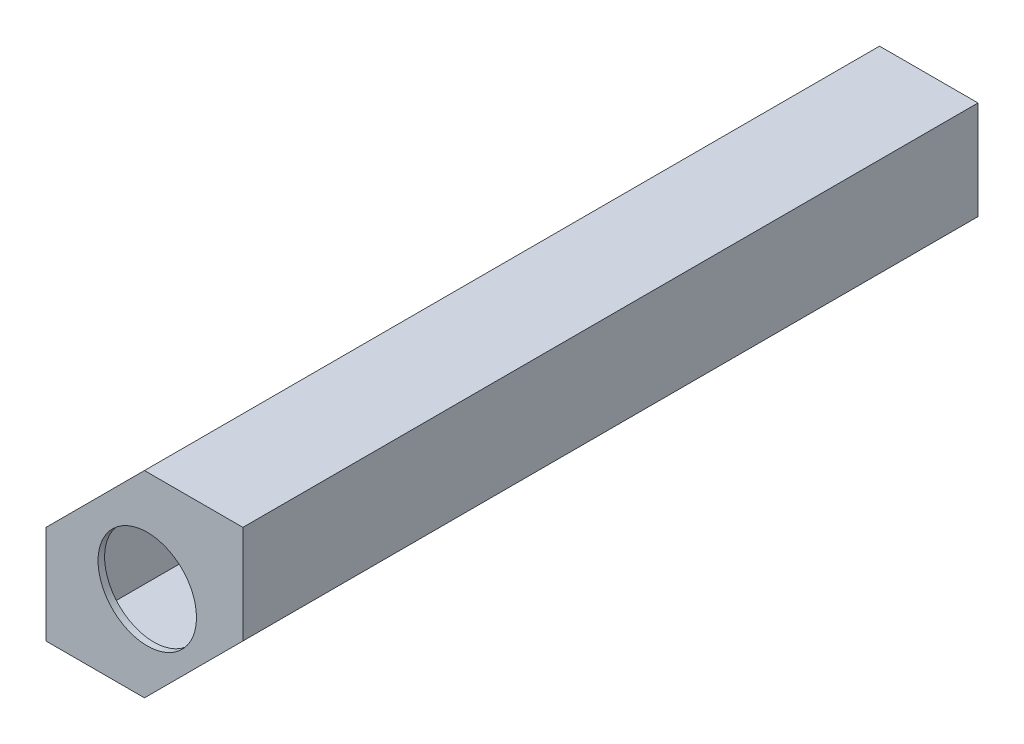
ISO-10303-21;
HEADER;
FILE_DESCRIPTION(('STEP AP214'),'2;1');
FILE_NAME('part.step','',(''),(''),'','','');
FILE_SCHEMA(('AUTOMOTIVE_DESIGN { 1 0 10303 214 1 1 1 1 }'));
ENDSEC;
DATA;
#1=APPLICATION_CONTEXT('core data for automotive mechanical design processes');
#2=APPLICATION_PROTOCOL_DEFINITION('international standard','automotive_design',2000,#1);
#3=PRODUCT_CONTEXT('',#1,'mechanical');
#4=PRODUCT('Part','Part','',(#3));
#5=PRODUCT_RELATED_PRODUCT_CATEGORY('part','',(#4));
#6=PRODUCT_DEFINITION_FORMATION('','',#4);
#7=PRODUCT_DEFINITION_CONTEXT('part definition',#1,'design');
#8=PRODUCT_DEFINITION('design','',#6,#7);
#9=PRODUCT_DEFINITION_SHAPE('','',#8);
#10=(LENGTH_UNIT() NAMED_UNIT(*) SI_UNIT(.MILLI.,.METRE.));
#11=(NAMED_UNIT(*) PLANE_ANGLE_UNIT() SI_UNIT($,.RADIAN.));
#12=(NAMED_UNIT(*) SI_UNIT($,.STERADIAN.) SOLID_ANGLE_UNIT());
#13=UNCERTAINTY_MEASURE_WITH_UNIT(LENGTH_MEASURE(1.E-05),#10,'distance_accuracy_value','');
#14=(GEOMETRIC_REPRESENTATION_CONTEXT(3) GLOBAL_UNCERTAINTY_ASSIGNED_CONTEXT((#13)) GLOBAL_UNIT_ASSIGNED_CONTEXT((#10,
#11,#12)) REPRESENTATION_CONTEXT('',''));
#15=CARTESIAN_POINT('',(0.,0.,0.));
#16=DIRECTION('',(0.,0.,1.));
#17=DIRECTION('',(1.,0.,0.));
#18=AXIS2_PLACEMENT_3D('',#15,#16,#17);
#19=CARTESIAN_POINT('',(150.,0.,10.));
#20=DIRECTION('',(0.,0.,-1.));
#21=DIRECTION('',(-1.,0.,0.));
#22=AXIS2_PLACEMENT_3D('',#19,#20,#21);
#23=PLANE('',#22);
#24=DIRECTION('',(0.,-1.,0.));
#25=VECTOR('',#24,1.);
#26=CARTESIAN_POINT('',(0.,300.,10.));
#27=LINE('',#26,#25);
#28=CARTESIAN_POINT('',(0.,300.,10.));
#29=VERTEX_POINT('',#28);
#30=CARTESIAN_POINT('',(0.,290.,10.));
#31=VERTEX_POINT('',#30);
#32=EDGE_CURVE('E513',#29,#31,#27,.T.);
#33=ORIENTED_EDGE('',*,*,#32,.F.);
#34=DIRECTION('',(-0.707106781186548,-0.707106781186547,0.));
#35=VECTOR('',#34,1.);
#36=CARTESIAN_POINT('',(0.,300.,10.));
#37=LINE('',#36,#35);
#38=CARTESIAN_POINT('',(-150.,150.,10.));
#39=VERTEX_POINT('',#38);
#40=EDGE_CURVE('E586',#29,#39,#37,.T.);
#41=ORIENTED_EDGE('',*,*,#40,.T.);
#42=DIRECTION('',(-1.,0.,0.));
#43=VECTOR('',#42,1.);
#44=CARTESIAN_POINT('',(-150.,150.,10.));
#45=LINE('',#44,#43);
#46=CARTESIAN_POINT('',(-140.,150.,10.));
#47=VERTEX_POINT('',#46);
#48=EDGE_CURVE('E534',#47,#39,#45,.T.);
#49=ORIENTED_EDGE('',*,*,#48,.F.);
#50=DIRECTION('',(0.,1.,0.));
#51=VECTOR('',#50,1.);
#52=CARTESIAN_POINT('',(-140.,150.,10.));
#53=LINE('',#52,#51);
#54=CARTESIAN_POINT('',(-140.,10.,10.));
#55=VERTEX_POINT('',#54);
#56=EDGE_CURVE('E543',#55,#47,#53,.T.);
#57=ORIENTED_EDGE('',*,*,#56,.F.);
#58=DIRECTION('',(-1.,0.,0.));
#59=VECTOR('',#58,1.);
#60=CARTESIAN_POINT('',(-140.,10.,10.));
#61=LINE('',#60,#59);
#62=CARTESIAN_POINT('',(0.,10.,10.));
#63=VERTEX_POINT('',#62);
#64=EDGE_CURVE('E540',#63,#55,#61,.T.);
#65=ORIENTED_EDGE('',*,*,#64,.F.);
#66=DIRECTION('',(0.,1.,0.));
#67=VECTOR('',#66,1.);
#68=CARTESIAN_POINT('',(0.,10.,10.));
#69=LINE('',#68,#67);
#70=CARTESIAN_POINT('',(0.,0.,10.));
#71=VERTEX_POINT('',#70);
#72=EDGE_CURVE('E537',#71,#63,#69,.T.);
#73=ORIENTED_EDGE('',*,*,#72,.F.);
#74=DIRECTION('',(0.707106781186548,0.707106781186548,0.));
#75=VECTOR('',#74,1.);
#76=CARTESIAN_POINT('',(150.,150.,10.));
#77=LINE('',#76,#75);
#78=CARTESIAN_POINT('',(150.,150.,10.));
#79=VERTEX_POINT('',#78);
#80=EDGE_CURVE('E584',#71,#79,#77,.T.);
#81=ORIENTED_EDGE('',*,*,#80,.T.);
#82=DIRECTION('',(1.,0.,0.));
#83=VECTOR('',#82,1.);
#84=CARTESIAN_POINT('',(140.,150.,10.));
#85=LINE('',#84,#83);
#86=CARTESIAN_POINT('',(140.,150.,10.));
#87=VERTEX_POINT('',#86);
#88=EDGE_CURVE('E469',#87,#79,#85,.T.);
#89=ORIENTED_EDGE('',*,*,#88,.F.);
#90=DIRECTION('',(0.,-1.,0.));
#91=VECTOR('',#90,1.);
#92=CARTESIAN_POINT('',(140.,150.,10.));
#93=LINE('',#92,#91);
#94=CARTESIAN_POINT('',(140.,290.,10.));
#95=VERTEX_POINT('',#94);
#96=EDGE_CURVE('E370',#95,#87,#93,.T.);
#97=ORIENTED_EDGE('',*,*,#96,.F.);
#98=DIRECTION('',(1.,0.,0.));
#99=VECTOR('',#98,1.);
#100=CARTESIAN_POINT('',(140.,290.,10.));
#101=LINE('',#100,#99);
#102=EDGE_CURVE('E365',#31,#95,#101,.T.);
#103=ORIENTED_EDGE('',*,*,#102,.F.);
#104=EDGE_LOOP('',(#33,#41,#49,#57,#65,#73,#81,#89,#97,#103));
#105=FACE_BOUND('',#104,.T.);
#106=ADVANCED_FACE('F350',(#105),#23,.F.);
#107=CARTESIAN_POINT('',(-150.,0.,10.));
#108=DIRECTION('',(0.,1.,0.));
#109=DIRECTION('',(0.,0.,1.));
#110=AXIS2_PLACEMENT_3D('',#107,#108,#109);
#111=PLANE('',#110);
#112=DIRECTION('',(1.,0.,0.));
#113=VECTOR('',#112,1.);
#114=CARTESIAN_POINT('',(-150.,0.,0.));
#115=LINE('',#114,#113);
#116=CARTESIAN_POINT('',(-150.,0.,0.));
#117=VERTEX_POINT('',#116);
#118=CARTESIAN_POINT('',(0.,0.,0.));
#119=VERTEX_POINT('',#118);
#120=EDGE_CURVE('E571',#117,#119,#115,.T.);
#121=ORIENTED_EDGE('',*,*,#120,.T.);
#122=DIRECTION('',(0.,0.,-1.));
#123=VECTOR('',#122,1.);
#124=CARTESIAN_POINT('',(0.,0.,10.));
#125=LINE('',#124,#123);
#126=EDGE_CURVE('E11',#71,#119,#125,.T.);
#127=ORIENTED_EDGE('',*,*,#126,.F.);
#128=DIRECTION('',(0.,0.,-1.));
#129=VECTOR('',#128,1.);
#130=CARTESIAN_POINT('',(0.,0.,1110.));
#131=LINE('',#130,#129);
#132=CARTESIAN_POINT('',(0.,0.,1110.));
#133=VERTEX_POINT('',#132);
#134=EDGE_CURVE('E565',#133,#71,#131,.T.);
#135=ORIENTED_EDGE('',*,*,#134,.F.);
#136=DIRECTION('',(0.,0.,-1.));
#137=VECTOR('',#136,1.);
#138=CARTESIAN_POINT('',(0.,0.,1120.));
#139=LINE('',#138,#137);
#140=CARTESIAN_POINT('',(0.,0.,1120.));
#141=VERTEX_POINT('',#140);
#142=EDGE_CURVE('E494',#141,#133,#139,.T.);
#143=ORIENTED_EDGE('',*,*,#142,.F.);
#144=DIRECTION('',(1.,0.,0.));
#145=VECTOR('',#144,1.);
#146=CARTESIAN_POINT('',(-150.,0.,1120.));
#147=LINE('',#146,#145);
#148=CARTESIAN_POINT('',(-150.,0.,1120.));
#149=VERTEX_POINT('',#148);
#150=EDGE_CURVE('E504',#149,#141,#147,.T.);
#151=ORIENTED_EDGE('',*,*,#150,.F.);
#152=DIRECTION('',(0.,0.,-1.));
#153=VECTOR('',#152,1.);
#154=CARTESIAN_POINT('',(-150.,0.,10.));
#155=LINE('',#154,#153);
#156=EDGE_CURVE('E588',#149,#117,#155,.T.);
#157=ORIENTED_EDGE('',*,*,#156,.T.);
#158=EDGE_LOOP('',(#121,#127,#135,#143,#151,#157));
#159=FACE_BOUND('',#158,.T.);
#160=ADVANCED_FACE('F352',(#159),#111,.F.);
#161=CARTESIAN_POINT('',(150.,150.,10.));
#162=DIRECTION('',(-0.707106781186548,0.707106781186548,0.));
#163=DIRECTION('',(-0.707106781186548,-0.707106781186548,0.));
#164=AXIS2_PLACEMENT_3D('',#161,#162,#163);
#165=PLANE('',#164);
#166=DIRECTION('',(0.707106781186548,0.707106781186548,0.));
#167=VECTOR('',#166,1.);
#168=CARTESIAN_POINT('',(150.,150.,0.));
#169=LINE('',#168,#167);
#170=CARTESIAN_POINT('',(150.,150.,0.));
#171=VERTEX_POINT('',#170);
#172=EDGE_CURVE('E574',#119,#171,#169,.T.);
#173=ORIENTED_EDGE('',*,*,#172,.T.);
#174=DIRECTION('',(0.,0.,-1.));
#175=VECTOR('',#174,1.);
#176=CARTESIAN_POINT('',(150.,150.,10.));
#177=LINE('',#176,#175);
#178=EDGE_CURVE('E358',#79,#171,#177,.T.);
#179=ORIENTED_EDGE('',*,*,#178,.F.);
#180=ORIENTED_EDGE('',*,*,#80,.F.);
#181=ORIENTED_EDGE('',*,*,#126,.T.);
#182=EDGE_LOOP('',(#173,#179,#180,#181));
#183=FACE_BOUND('',#182,.T.);
#184=ADVANCED_FACE('F672',(#183),#165,.F.);
#185=CARTESIAN_POINT('',(150.,300.,10.));
#186=DIRECTION('',(-1.,0.,0.));
#187=DIRECTION('',(0.,0.,1.));
#188=AXIS2_PLACEMENT_3D('',#185,#186,#187);
#189=PLANE('',#188);
#190=DIRECTION('',(0.,1.,0.));
#191=VECTOR('',#190,1.);
#192=CARTESIAN_POINT('',(150.,300.,0.));
#193=LINE('',#192,#191);
#194=CARTESIAN_POINT('',(150.,300.,0.));
#195=VERTEX_POINT('',#194);
#196=EDGE_CURVE('E576',#171,#195,#193,.T.);
#197=ORIENTED_EDGE('',*,*,#196,.T.);
#198=DIRECTION('',(0.,0.,-1.));
#199=VECTOR('',#198,1.);
#200=CARTESIAN_POINT('',(150.,300.,10.));
#201=LINE('',#200,#199);
#202=CARTESIAN_POINT('',(150.,300.,1120.));
#203=VERTEX_POINT('',#202);
#204=EDGE_CURVE('E597',#203,#195,#201,.T.);
#205=ORIENTED_EDGE('',*,*,#204,.F.);
#206=DIRECTION('',(0.,1.,0.));
#207=VECTOR('',#206,1.);
#208=CARTESIAN_POINT('',(150.,150.,1120.));
#209=LINE('',#208,#207);
#210=CARTESIAN_POINT('',(150.,150.,1120.));
#211=VERTEX_POINT('',#210);
#212=EDGE_CURVE('E495',#211,#203,#209,.T.);
#213=ORIENTED_EDGE('',*,*,#212,.F.);
#214=DIRECTION('',(0.,0.,-1.));
#215=VECTOR('',#214,1.);
#216=CARTESIAN_POINT('',(150.,150.,1120.));
#217=LINE('',#216,#215);
#218=CARTESIAN_POINT('',(150.,150.,1110.));
#219=VERTEX_POINT('',#218);
#220=EDGE_CURVE('E491',#211,#219,#217,.T.);
#221=ORIENTED_EDGE('',*,*,#220,.T.);
#222=DIRECTION('',(0.,0.,-1.));
#223=VECTOR('',#222,1.);
#224=CARTESIAN_POINT('',(150.,150.,1110.));
#225=LINE('',#224,#223);
#226=EDGE_CURVE('E463',#219,#79,#225,.T.);
#227=ORIENTED_EDGE('',*,*,#226,.T.);
#228=ORIENTED_EDGE('',*,*,#178,.T.);
#229=EDGE_LOOP('',(#197,#205,#213,#221,#227,#228));
#230=FACE_BOUND('',#229,.T.);
#231=ADVANCED_FACE('F498',(#230),#189,.F.);
#232=CARTESIAN_POINT('',(0.,300.,10.));
#233=DIRECTION('',(0.,-1.,0.));
#234=DIRECTION('',(1.,0.,0.));
#235=AXIS2_PLACEMENT_3D('',#232,#233,#234);
#236=PLANE('',#235);
#237=DIRECTION('',(-1.,0.,0.));
#238=VECTOR('',#237,1.);
#239=CARTESIAN_POINT('',(0.,300.,0.));
#240=LINE('',#239,#238);
#241=CARTESIAN_POINT('',(0.,300.,0.));
#242=VERTEX_POINT('',#241);
#243=EDGE_CURVE('E578',#195,#242,#240,.T.);
#244=ORIENTED_EDGE('',*,*,#243,.T.);
#245=DIRECTION('',(0.,0.,-1.));
#246=VECTOR('',#245,1.);
#247=CARTESIAN_POINT('',(0.,300.,10.));
#248=LINE('',#247,#246);
#249=EDGE_CURVE('E594',#29,#242,#248,.T.);
#250=ORIENTED_EDGE('',*,*,#249,.F.);
#251=DIRECTION('',(0.,0.,-1.));
#252=VECTOR('',#251,1.);
#253=CARTESIAN_POINT('',(0.,300.,1110.));
#254=LINE('',#253,#252);
#255=CARTESIAN_POINT('',(0.,300.,1110.));
#256=VERTEX_POINT('',#255);
#257=EDGE_CURVE('E531',#256,#29,#254,.T.);
#258=ORIENTED_EDGE('',*,*,#257,.F.);
#259=DIRECTION('',(0.,0.,-1.));
#260=VECTOR('',#259,1.);
#261=CARTESIAN_POINT('',(0.,300.,1120.));
#262=LINE('',#261,#260);
#263=CARTESIAN_POINT('',(0.,300.,1120.));
#264=VERTEX_POINT('',#263);
#265=EDGE_CURVE('E510',#264,#256,#262,.T.);
#266=ORIENTED_EDGE('',*,*,#265,.F.);
#267=DIRECTION('',(-1.,0.,0.));
#268=VECTOR('',#267,1.);
#269=CARTESIAN_POINT('',(150.,300.,1120.));
#270=LINE('',#269,#268);
#271=EDGE_CURVE('E621',#203,#264,#270,.T.);
#272=ORIENTED_EDGE('',*,*,#271,.F.);
#273=ORIENTED_EDGE('',*,*,#204,.T.);
#274=EDGE_LOOP('',(#244,#250,#258,#266,#272,#273));
#275=FACE_BOUND('',#274,.T.);
#276=ADVANCED_FACE('F611',(#275),#236,.F.);
#277=CARTESIAN_POINT('',(0.,300.,10.));
#278=DIRECTION('',(0.707106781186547,-0.707106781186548,0.));
#279=DIRECTION('',(0.707106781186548,0.707106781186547,0.));
#280=AXIS2_PLACEMENT_3D('',#277,#278,#279);
#281=PLANE('',#280);
#282=DIRECTION('',(-0.707106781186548,-0.707106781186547,0.));
#283=VECTOR('',#282,1.);
#284=CARTESIAN_POINT('',(0.,300.,0.));
#285=LINE('',#284,#283);
#286=CARTESIAN_POINT('',(-150.,150.,0.));
#287=VERTEX_POINT('',#286);
#288=EDGE_CURVE('E580',#242,#287,#285,.T.);
#289=ORIENTED_EDGE('',*,*,#288,.T.);
#290=DIRECTION('',(0.,0.,-1.));
#291=VECTOR('',#290,1.);
#292=CARTESIAN_POINT('',(-150.,150.,10.));
#293=LINE('',#292,#291);
#294=EDGE_CURVE('E591',#39,#287,#293,.T.);
#295=ORIENTED_EDGE('',*,*,#294,.F.);
#296=ORIENTED_EDGE('',*,*,#40,.F.);
#297=ORIENTED_EDGE('',*,*,#249,.T.);
#298=EDGE_LOOP('',(#289,#295,#296,#297));
#299=FACE_BOUND('',#298,.T.);
#300=ADVANCED_FACE('F614',(#299),#281,.F.);
#301=CARTESIAN_POINT('',(-150.,150.,10.));
#302=DIRECTION('',(1.,0.,0.));
#303=DIRECTION('',(0.,1.,0.));
#304=AXIS2_PLACEMENT_3D('',#301,#302,#303);
#305=PLANE('',#304);
#306=DIRECTION('',(0.,-1.,0.));
#307=VECTOR('',#306,1.);
#308=CARTESIAN_POINT('',(-150.,150.,0.));
#309=LINE('',#308,#307);
#310=EDGE_CURVE('E582',#287,#117,#309,.T.);
#311=ORIENTED_EDGE('',*,*,#310,.T.);
#312=ORIENTED_EDGE('',*,*,#156,.F.);
#313=DIRECTION('',(0.,-1.,0.));
#314=VECTOR('',#313,1.);
#315=CARTESIAN_POINT('',(-150.,150.,1120.));
#316=LINE('',#315,#314);
#317=CARTESIAN_POINT('',(-150.,150.,1120.));
#318=VERTEX_POINT('',#317);
#319=EDGE_CURVE('E631',#318,#149,#316,.T.);
#320=ORIENTED_EDGE('',*,*,#319,.F.);
#321=DIRECTION('',(0.,0.,-1.));
#322=VECTOR('',#321,1.);
#323=CARTESIAN_POINT('',(-150.,150.,1120.));
#324=LINE('',#323,#322);
#325=CARTESIAN_POINT('',(-150.,150.,1110.));
#326=VERTEX_POINT('',#325);
#327=EDGE_CURVE('E502',#318,#326,#324,.T.);
#328=ORIENTED_EDGE('',*,*,#327,.T.);
#329=DIRECTION('',(0.,0.,-1.));
#330=VECTOR('',#329,1.);
#331=CARTESIAN_POINT('',(-150.,150.,1110.));
#332=LINE('',#331,#330);
#333=EDGE_CURVE('E568',#326,#39,#332,.T.);
#334=ORIENTED_EDGE('',*,*,#333,.T.);
#335=ORIENTED_EDGE('',*,*,#294,.T.);
#336=EDGE_LOOP('',(#311,#312,#320,#328,#334,#335));
#337=FACE_BOUND('',#336,.T.);
#338=ADVANCED_FACE('F655',(#337),#305,.F.);
#339=CARTESIAN_POINT('',(150.,0.,0.));
#340=DIRECTION('',(0.,0.,-1.));
#341=DIRECTION('',(-1.,0.,0.));
#342=AXIS2_PLACEMENT_3D('',#339,#340,#341);
#343=PLANE('',#342);
#344=ORIENTED_EDGE('',*,*,#120,.F.);
#345=ORIENTED_EDGE('',*,*,#310,.F.);
#346=ORIENTED_EDGE('',*,*,#288,.F.);
#347=ORIENTED_EDGE('',*,*,#243,.F.);
#348=ORIENTED_EDGE('',*,*,#196,.F.);
#349=ORIENTED_EDGE('',*,*,#172,.F.);
#350=EDGE_LOOP('',(#344,#345,#346,#347,#348,#349));
#351=FACE_BOUND('',#350,.T.);
#352=ADVANCED_FACE('F606',(#351),#343,.T.);
#353=CARTESIAN_POINT('',(-150.,150.,1110.));
#354=DIRECTION('',(0.,-1.,0.));
#355=DIRECTION('',(0.,0.,-1.));
#356=AXIS2_PLACEMENT_3D('',#353,#354,#355);
#357=PLANE('',#356);
#358=ORIENTED_EDGE('',*,*,#48,.T.);
#359=ORIENTED_EDGE('',*,*,#333,.F.);
#360=DIRECTION('',(-1.,0.,0.));
#361=VECTOR('',#360,1.);
#362=CARTESIAN_POINT('',(-150.,150.,1110.));
#363=LINE('',#362,#361);
#364=CARTESIAN_POINT('',(-140.,150.,1110.));
#365=VERTEX_POINT('',#364);
#366=EDGE_CURVE('E546',#365,#326,#363,.T.);
#367=ORIENTED_EDGE('',*,*,#366,.F.);
#368=DIRECTION('',(0.,0.,-1.));
#369=VECTOR('',#368,1.);
#370=CARTESIAN_POINT('',(-140.,150.,1110.));
#371=LINE('',#370,#369);
#372=EDGE_CURVE('E556',#365,#47,#371,.T.);
#373=ORIENTED_EDGE('',*,*,#372,.T.);
#374=EDGE_LOOP('',(#358,#359,#367,#373));
#375=FACE_BOUND('',#374,.T.);
#376=ADVANCED_FACE('F651',(#375),#357,.F.);
#377=CARTESIAN_POINT('',(0.,10.,1110.));
#378=DIRECTION('',(-1.,0.,0.));
#379=DIRECTION('',(0.,0.,1.));
#380=AXIS2_PLACEMENT_3D('',#377,#378,#379);
#381=PLANE('',#380);
#382=ORIENTED_EDGE('',*,*,#72,.T.);
#383=DIRECTION('',(0.,0.,-1.));
#384=VECTOR('',#383,1.);
#385=CARTESIAN_POINT('',(0.,10.,1110.));
#386=LINE('',#385,#384);
#387=CARTESIAN_POINT('',(0.,10.,1110.));
#388=VERTEX_POINT('',#387);
#389=EDGE_CURVE('E562',#388,#63,#386,.T.);
#390=ORIENTED_EDGE('',*,*,#389,.F.);
#391=DIRECTION('',(0.,1.,0.));
#392=VECTOR('',#391,1.);
#393=CARTESIAN_POINT('',(0.,10.,1110.));
#394=LINE('',#393,#392);
#395=EDGE_CURVE('E549',#133,#388,#394,.T.);
#396=ORIENTED_EDGE('',*,*,#395,.F.);
#397=ORIENTED_EDGE('',*,*,#134,.T.);
#398=EDGE_LOOP('',(#382,#390,#396,#397));
#399=FACE_BOUND('',#398,.T.);
#400=ADVANCED_FACE('F642',(#399),#381,.F.);
#401=CARTESIAN_POINT('',(-140.,10.,1110.));
#402=DIRECTION('',(0.,-1.,0.));
#403=DIRECTION('',(1.,0.,0.));
#404=AXIS2_PLACEMENT_3D('',#401,#402,#403);
#405=PLANE('',#404);
#406=ORIENTED_EDGE('',*,*,#64,.T.);
#407=DIRECTION('',(0.,0.,-1.));
#408=VECTOR('',#407,1.);
#409=CARTESIAN_POINT('',(-140.,10.,1110.));
#410=LINE('',#409,#408);
#411=CARTESIAN_POINT('',(-140.,10.,1110.));
#412=VERTEX_POINT('',#411);
#413=EDGE_CURVE('E559',#412,#55,#410,.T.);
#414=ORIENTED_EDGE('',*,*,#413,.F.);
#415=DIRECTION('',(-1.,0.,0.));
#416=VECTOR('',#415,1.);
#417=CARTESIAN_POINT('',(-140.,10.,1110.));
#418=LINE('',#417,#416);
#419=EDGE_CURVE('E551',#388,#412,#418,.T.);
#420=ORIENTED_EDGE('',*,*,#419,.F.);
#421=ORIENTED_EDGE('',*,*,#389,.T.);
#422=EDGE_LOOP('',(#406,#414,#420,#421));
#423=FACE_BOUND('',#422,.T.);
#424=ADVANCED_FACE('F646',(#423),#405,.F.);
#425=CARTESIAN_POINT('',(-140.,150.,1110.));
#426=DIRECTION('',(-1.,0.,0.));
#427=DIRECTION('',(0.,-1.,0.));
#428=AXIS2_PLACEMENT_3D('',#425,#426,#427);
#429=PLANE('',#428);
#430=ORIENTED_EDGE('',*,*,#56,.T.);
#431=ORIENTED_EDGE('',*,*,#372,.F.);
#432=DIRECTION('',(0.,1.,0.));
#433=VECTOR('',#432,1.);
#434=CARTESIAN_POINT('',(-140.,150.,1110.));
#435=LINE('',#434,#433);
#436=EDGE_CURVE('E554',#412,#365,#435,.T.);
#437=ORIENTED_EDGE('',*,*,#436,.F.);
#438=ORIENTED_EDGE('',*,*,#413,.T.);
#439=EDGE_LOOP('',(#430,#431,#437,#438));
#440=FACE_BOUND('',#439,.T.);
#441=ADVANCED_FACE('F649',(#440),#429,.F.);
#442=CARTESIAN_POINT('',(0.,300.,1110.));
#443=DIRECTION('',(1.,0.,0.));
#444=DIRECTION('',(0.,0.,-1.));
#445=AXIS2_PLACEMENT_3D('',#442,#443,#444);
#446=PLANE('',#445);
#447=ORIENTED_EDGE('',*,*,#32,.T.);
#448=DIRECTION('',(0.,0.,-1.));
#449=VECTOR('',#448,1.);
#450=CARTESIAN_POINT('',(0.,290.,1110.));
#451=LINE('',#450,#449);
#452=CARTESIAN_POINT('',(0.,290.,1110.));
#453=VERTEX_POINT('',#452);
#454=EDGE_CURVE('E528',#453,#31,#451,.T.);
#455=ORIENTED_EDGE('',*,*,#454,.F.);
#456=DIRECTION('',(0.,-1.,0.));
#457=VECTOR('',#456,1.);
#458=CARTESIAN_POINT('',(0.,300.,1110.));
#459=LINE('',#458,#457);
#460=EDGE_CURVE('E518',#256,#453,#459,.T.);
#461=ORIENTED_EDGE('',*,*,#460,.F.);
#462=ORIENTED_EDGE('',*,*,#257,.T.);
#463=EDGE_LOOP('',(#447,#455,#461,#462));
#464=FACE_BOUND('',#463,.T.);
#465=ADVANCED_FACE('F618',(#464),#446,.F.);
#466=CARTESIAN_POINT('',(140.,290.,1110.));
#467=DIRECTION('',(0.,1.,0.));
#468=DIRECTION('',(-1.,0.,0.));
#469=AXIS2_PLACEMENT_3D('',#466,#467,#468);
#470=PLANE('',#469);
#471=ORIENTED_EDGE('',*,*,#102,.T.);
#472=DIRECTION('',(0.,0.,-1.));
#473=VECTOR('',#472,1.);
#474=CARTESIAN_POINT('',(140.,290.,1110.));
#475=LINE('',#474,#473);
#476=CARTESIAN_POINT('',(140.,290.,1110.));
#477=VERTEX_POINT('',#476);
#478=EDGE_CURVE('E525',#477,#95,#475,.T.);
#479=ORIENTED_EDGE('',*,*,#478,.F.);
#480=DIRECTION('',(1.,0.,0.));
#481=VECTOR('',#480,1.);
#482=CARTESIAN_POINT('',(140.,290.,1110.));
#483=LINE('',#482,#481);
#484=EDGE_CURVE('E521',#453,#477,#483,.T.);
#485=ORIENTED_EDGE('',*,*,#484,.F.);
#486=ORIENTED_EDGE('',*,*,#454,.T.);
#487=EDGE_LOOP('',(#471,#479,#485,#486));
#488=FACE_BOUND('',#487,.T.);
#489=ADVANCED_FACE('F683',(#488),#470,.F.);
#490=CARTESIAN_POINT('',(140.,150.,1110.));
#491=DIRECTION('',(1.,0.,0.));
#492=DIRECTION('',(0.,0.,-1.));
#493=AXIS2_PLACEMENT_3D('',#490,#491,#492);
#494=PLANE('',#493);
#495=ORIENTED_EDGE('',*,*,#96,.T.);
#496=DIRECTION('',(0.,0.,-1.));
#497=VECTOR('',#496,1.);
#498=CARTESIAN_POINT('',(140.,150.,1110.));
#499=LINE('',#498,#497);
#500=CARTESIAN_POINT('',(140.,150.,1110.));
#501=VERTEX_POINT('',#500);
#502=EDGE_CURVE('E473',#501,#87,#499,.T.);
#503=ORIENTED_EDGE('',*,*,#502,.F.);
#504=DIRECTION('',(0.,-1.,0.));
#505=VECTOR('',#504,1.);
#506=CARTESIAN_POINT('',(140.,150.,1110.));
#507=LINE('',#506,#505);
#508=EDGE_CURVE('E484',#477,#501,#507,.T.);
#509=ORIENTED_EDGE('',*,*,#508,.F.);
#510=ORIENTED_EDGE('',*,*,#478,.T.);
#511=EDGE_LOOP('',(#495,#503,#509,#510));
#512=FACE_BOUND('',#511,.T.);
#513=ADVANCED_FACE('F686',(#512),#494,.F.);
#514=CARTESIAN_POINT('',(140.,150.,1110.));
#515=DIRECTION('',(0.,1.,0.));
#516=DIRECTION('',(0.,0.,1.));
#517=AXIS2_PLACEMENT_3D('',#514,#515,#516);
#518=PLANE('',#517);
#519=ORIENTED_EDGE('',*,*,#88,.T.);
#520=ORIENTED_EDGE('',*,*,#226,.F.);
#521=DIRECTION('',(1.,0.,0.));
#522=VECTOR('',#521,1.);
#523=CARTESIAN_POINT('',(140.,150.,1110.));
#524=LINE('',#523,#522);
#525=EDGE_CURVE('E467',#501,#219,#524,.T.);
#526=ORIENTED_EDGE('',*,*,#525,.F.);
#527=ORIENTED_EDGE('',*,*,#502,.T.);
#528=EDGE_LOOP('',(#519,#520,#526,#527));
#529=FACE_BOUND('',#528,.T.);
#530=ADVANCED_FACE('F465',(#529),#518,.F.);
#531=CARTESIAN_POINT('',(0.,300.,1120.));
#532=DIRECTION('',(0.707106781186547,-0.707106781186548,0.));
#533=DIRECTION('',(0.707106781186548,0.707106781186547,0.));
#534=AXIS2_PLACEMENT_3D('',#531,#532,#533);
#535=PLANE('',#534);
#536=DIRECTION('',(-0.707106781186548,-0.707106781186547,0.));
#537=VECTOR('',#536,1.);
#538=CARTESIAN_POINT('',(0.,300.,1110.));
#539=LINE('',#538,#537);
#540=EDGE_CURVE('E496',#256,#326,#539,.T.);
#541=ORIENTED_EDGE('',*,*,#540,.T.);
#542=ORIENTED_EDGE('',*,*,#327,.F.);
#543=DIRECTION('',(-0.707106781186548,-0.707106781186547,0.));
#544=VECTOR('',#543,1.);
#545=CARTESIAN_POINT('',(0.,300.,1120.));
#546=LINE('',#545,#544);
#547=EDGE_CURVE('E626',#264,#318,#546,.T.);
#548=ORIENTED_EDGE('',*,*,#547,.F.);
#549=ORIENTED_EDGE('',*,*,#265,.T.);
#550=EDGE_LOOP('',(#541,#542,#548,#549));
#551=FACE_BOUND('',#550,.T.);
#552=ADVANCED_FACE('F627',(#551),#535,.F.);
#553=CARTESIAN_POINT('',(0.,0.,1120.));
#554=DIRECTION('',(-0.707106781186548,0.707106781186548,0.));
#555=DIRECTION('',(-0.707106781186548,-0.707106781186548,0.));
#556=AXIS2_PLACEMENT_3D('',#553,#554,#555);
#557=PLANE('',#556);
#558=DIRECTION('',(0.707106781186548,0.707106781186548,0.));
#559=VECTOR('',#558,1.);
#560=CARTESIAN_POINT('',(0.,0.,1110.));
#561=LINE('',#560,#559);
#562=EDGE_CURVE('E481',#133,#219,#561,.T.);
#563=ORIENTED_EDGE('',*,*,#562,.T.);
#564=ORIENTED_EDGE('',*,*,#220,.F.);
#565=DIRECTION('',(0.707106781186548,0.707106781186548,0.));
#566=VECTOR('',#565,1.);
#567=CARTESIAN_POINT('',(0.,0.,1120.));
#568=LINE('',#567,#566);
#569=EDGE_CURVE('E500',#141,#211,#568,.T.);
#570=ORIENTED_EDGE('',*,*,#569,.F.);
#571=ORIENTED_EDGE('',*,*,#142,.T.);
#572=EDGE_LOOP('',(#563,#564,#570,#571));
#573=FACE_BOUND('',#572,.T.);
#574=ADVANCED_FACE('F489',(#573),#557,.F.);
#575=CARTESIAN_POINT('',(150.,0.,1120.));
#576=DIRECTION('',(0.,0.,-1.));
#577=DIRECTION('',(-1.,0.,0.));
#578=AXIS2_PLACEMENT_3D('',#575,#576,#577);
#579=PLANE('',#578);
#580=CARTESIAN_POINT('',(4.28932188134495,145.710678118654,1120.));
#581=DIRECTION('',(0.,0.,1.));
#582=DIRECTION('',(1.,0.,0.));
#583=AXIS2_PLACEMENT_3D('',#580,#581,#582);
#584=CIRCLE('',#583,75.);
#585=CARTESIAN_POINT('',(79.289321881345,145.710678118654,1120.));
#586=VERTEX_POINT('',#585);
#587=EDGE_CURVE('E713',#586,#586,#584,.T.);
#588=ORIENTED_EDGE('',*,*,#587,.F.);
#589=EDGE_LOOP('',(#588));
#590=FACE_BOUND('',#589,.T.);
#591=ORIENTED_EDGE('',*,*,#212,.T.);
#592=ORIENTED_EDGE('',*,*,#271,.T.);
#593=ORIENTED_EDGE('',*,*,#547,.T.);
#594=ORIENTED_EDGE('',*,*,#319,.T.);
#595=ORIENTED_EDGE('',*,*,#150,.T.);
#596=ORIENTED_EDGE('',*,*,#569,.T.);
#597=EDGE_LOOP('',(#591,#592,#593,#594,#595,#596));
#598=FACE_BOUND('',#597,.T.);
#599=ADVANCED_FACE('F637',(#590,#598),#579,.F.);
#600=CARTESIAN_POINT('',(150.,0.,1110.));
#601=DIRECTION('',(0.,0.,-1.));
#602=DIRECTION('',(-1.,0.,0.));
#603=AXIS2_PLACEMENT_3D('',#600,#601,#602);
#604=PLANE('',#603);
#605=CARTESIAN_POINT('',(4.28932188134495,145.710678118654,1110.));
#606=DIRECTION('',(0.,0.,1.));
#607=DIRECTION('',(1.,0.,0.));
#608=AXIS2_PLACEMENT_3D('',#605,#606,#607);
#609=CIRCLE('',#608,75.);
#610=CARTESIAN_POINT('',(79.289321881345,145.710678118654,1110.));
#611=VERTEX_POINT('',#610);
#612=EDGE_CURVE('E652',#611,#611,#609,.T.);
#613=ORIENTED_EDGE('',*,*,#612,.T.);
#614=EDGE_LOOP('',(#613));
#615=FACE_BOUND('',#614,.T.);
#616=ORIENTED_EDGE('',*,*,#436,.T.);
#617=ORIENTED_EDGE('',*,*,#366,.T.);
#618=ORIENTED_EDGE('',*,*,#540,.F.);
#619=ORIENTED_EDGE('',*,*,#460,.T.);
#620=ORIENTED_EDGE('',*,*,#484,.T.);
#621=ORIENTED_EDGE('',*,*,#508,.T.);
#622=ORIENTED_EDGE('',*,*,#525,.T.);
#623=ORIENTED_EDGE('',*,*,#562,.F.);
#624=ORIENTED_EDGE('',*,*,#395,.T.);
#625=ORIENTED_EDGE('',*,*,#419,.T.);
#626=EDGE_LOOP('',(#616,#617,#618,#619,#620,#621,#622,#623,#624,#625));
#627=FACE_BOUND('',#626,.T.);
#628=ADVANCED_FACE('F479',(#615,#627),#604,.T.);
#629=CARTESIAN_POINT('',(4.28932188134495,145.710678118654,1110.));
#630=DIRECTION('',(0.,0.,1.));
#631=DIRECTION('',(1.,0.,0.));
#632=AXIS2_PLACEMENT_3D('',#629,#630,#631);
#633=CYLINDRICAL_SURFACE('',#632,75.);
#634=ORIENTED_EDGE('',*,*,#612,.F.);
#635=EDGE_LOOP('',(#634));
#636=FACE_BOUND('',#635,.T.);
#637=ORIENTED_EDGE('',*,*,#587,.T.);
#638=EDGE_LOOP('',(#637));
#639=FACE_BOUND('',#638,.T.);
#640=ADVANCED_FACE('F702',(#636,#639),#633,.F.);
#641=CLOSED_SHELL('',(#106,#160,#184,#231,#276,#300,#338,#352,#376,#400,#424,#441,#465,#489,
#513,#530,#552,#574,#599,#628,#640));
#642=MANIFOLD_SOLID_BREP('B2',#641);
#643=ADVANCED_BREP_SHAPE_REPRESENTATION('',(#18,#642),#14);
#644=SHAPE_DEFINITION_REPRESENTATION(#9,#643);
ENDSEC;
END-ISO-10303-21;
